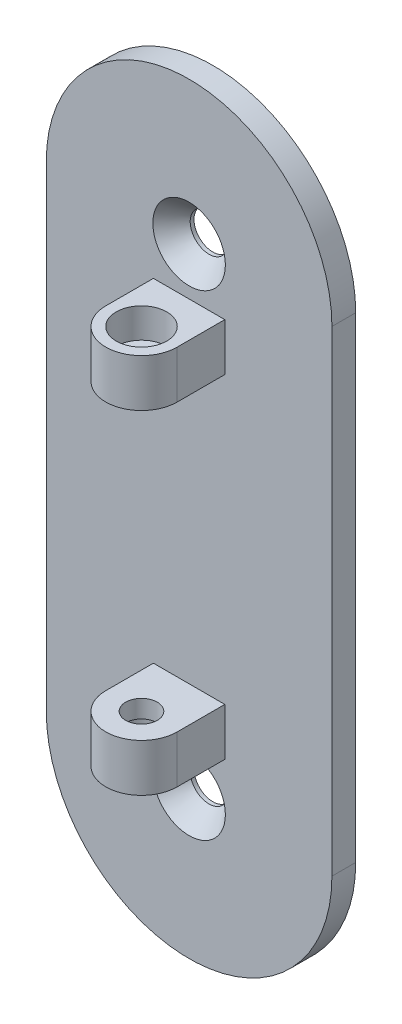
ISO-10303-21;
HEADER;
FILE_DESCRIPTION(('STEP AP214'),'2;1');
FILE_NAME('part.step','',(''),(''),'','','');
FILE_SCHEMA(('AUTOMOTIVE_DESIGN { 1 0 10303 214 1 1 1 1 }'));
ENDSEC;
DATA;
#1=APPLICATION_CONTEXT('core data for automotive mechanical design processes');
#2=APPLICATION_PROTOCOL_DEFINITION('international standard','automotive_design',2000,#1);
#3=PRODUCT_CONTEXT('',#1,'mechanical');
#4=PRODUCT('Part','Part','',(#3));
#5=PRODUCT_RELATED_PRODUCT_CATEGORY('part','',(#4));
#6=PRODUCT_DEFINITION_FORMATION('','',#4);
#7=PRODUCT_DEFINITION_CONTEXT('part definition',#1,'design');
#8=PRODUCT_DEFINITION('design','',#6,#7);
#9=PRODUCT_DEFINITION_SHAPE('','',#8);
#10=(LENGTH_UNIT() NAMED_UNIT(*) SI_UNIT(.MILLI.,.METRE.));
#11=(NAMED_UNIT(*) PLANE_ANGLE_UNIT() SI_UNIT($,.RADIAN.));
#12=(NAMED_UNIT(*) SI_UNIT($,.STERADIAN.) SOLID_ANGLE_UNIT());
#13=UNCERTAINTY_MEASURE_WITH_UNIT(LENGTH_MEASURE(1.E-05),#10,'distance_accuracy_value','');
#14=(GEOMETRIC_REPRESENTATION_CONTEXT(3) GLOBAL_UNCERTAINTY_ASSIGNED_CONTEXT((#13)) GLOBAL_UNIT_ASSIGNED_CONTEXT((#10,
#11,#12)) REPRESENTATION_CONTEXT('',''));
#15=CARTESIAN_POINT('',(0.,0.,0.));
#16=DIRECTION('',(0.,0.,1.));
#17=DIRECTION('',(1.,0.,0.));
#18=AXIS2_PLACEMENT_3D('',#15,#16,#17);
#19=CARTESIAN_POINT('',(38.1,63.5,6.35));
#20=DIRECTION('',(0.,0.,-1.));
#21=DIRECTION('',(-1.,0.,0.));
#22=AXIS2_PLACEMENT_3D('',#19,#20,#21);
#23=PLANE('',#22);
#24=DIRECTION('',(0.,-1.,0.));
#25=VECTOR('',#24,1.);
#26=CARTESIAN_POINT('',(0.,0.,6.35));
#27=LINE('',#26,#25);
#28=CARTESIAN_POINT('',(0.,63.5,6.35));
#29=VERTEX_POINT('',#28);
#30=CARTESIAN_POINT('',(0.,-63.5,6.35));
#31=VERTEX_POINT('',#30);
#32=EDGE_CURVE('E240',#29,#31,#27,.T.);
#33=ORIENTED_EDGE('',*,*,#32,.T.);
#34=CARTESIAN_POINT('',(38.1,-63.5,6.35));
#35=DIRECTION('',(0.,0.,-1.));
#36=DIRECTION('',(-1.,0.,0.));
#37=AXIS2_PLACEMENT_3D('',#34,#35,#36);
#38=CIRCLE('',#37,38.1);
#39=CARTESIAN_POINT('',(76.2,-63.5,6.35));
#40=VERTEX_POINT('',#39);
#41=EDGE_CURVE('E169',#40,#31,#38,.T.);
#42=ORIENTED_EDGE('',*,*,#41,.F.);
#43=DIRECTION('',(0.,1.,0.));
#44=VECTOR('',#43,1.);
#45=CARTESIAN_POINT('',(76.2,63.5,6.35));
#46=LINE('',#45,#44);
#47=CARTESIAN_POINT('',(76.2,63.5,6.35));
#48=VERTEX_POINT('',#47);
#49=EDGE_CURVE('E236',#40,#48,#46,.T.);
#50=ORIENTED_EDGE('',*,*,#49,.T.);
#51=CARTESIAN_POINT('',(38.1,63.5,6.35));
#52=DIRECTION('',(0.,0.,1.));
#53=DIRECTION('',(-1.,0.,0.));
#54=AXIS2_PLACEMENT_3D('',#51,#52,#53);
#55=CIRCLE('',#54,38.1);
#56=EDGE_CURVE('E238',#48,#29,#55,.T.);
#57=ORIENTED_EDGE('',*,*,#56,.T.);
#58=EDGE_LOOP('',(#33,#42,#50,#57));
#59=FACE_BOUND('',#58,.T.);
#60=CARTESIAN_POINT('',(38.1,63.5,6.35));
#61=DIRECTION('',(0.,0.,1.));
#62=DIRECTION('',(1.,0.,0.));
#63=AXIS2_PLACEMENT_3D('',#60,#61,#62);
#64=CIRCLE('',#63,9.6774);
#65=CARTESIAN_POINT('',(47.7774,63.5,6.35));
#66=VERTEX_POINT('',#65);
#67=EDGE_CURVE('E227',#66,#66,#64,.T.);
#68=ORIENTED_EDGE('',*,*,#67,.F.);
#69=EDGE_LOOP('',(#68));
#70=FACE_BOUND('',#69,.T.);
#71=DIRECTION('',(0.,-1.,0.));
#72=VECTOR('',#71,1.);
#73=CARTESIAN_POINT('',(28.575,50.8,6.35));
#74=LINE('',#73,#72);
#75=CARTESIAN_POINT('',(28.575,50.8,6.35));
#76=VERTEX_POINT('',#75);
#77=CARTESIAN_POINT('',(28.575,38.1,6.35));
#78=VERTEX_POINT('',#77);
#79=EDGE_CURVE('E194',#76,#78,#74,.T.);
#80=ORIENTED_EDGE('',*,*,#79,.F.);
#81=DIRECTION('',(-1.,0.,0.));
#82=VECTOR('',#81,1.);
#83=CARTESIAN_POINT('',(28.575,50.8,6.35));
#84=LINE('',#83,#82);
#85=CARTESIAN_POINT('',(47.625,50.8,6.35));
#86=VERTEX_POINT('',#85);
#87=EDGE_CURVE('E201',#86,#76,#84,.T.);
#88=ORIENTED_EDGE('',*,*,#87,.F.);
#89=DIRECTION('',(0.,1.,0.));
#90=VECTOR('',#89,1.);
#91=CARTESIAN_POINT('',(47.625,50.8,6.35));
#92=LINE('',#91,#90);
#93=CARTESIAN_POINT('',(47.625,38.1,6.35));
#94=VERTEX_POINT('',#93);
#95=EDGE_CURVE('E46',#94,#86,#92,.T.);
#96=ORIENTED_EDGE('',*,*,#95,.F.);
#97=DIRECTION('',(1.,0.,0.));
#98=VECTOR('',#97,1.);
#99=CARTESIAN_POINT('',(28.575,38.1,6.35));
#100=LINE('',#99,#98);
#101=EDGE_CURVE('E41',#78,#94,#100,.T.);
#102=ORIENTED_EDGE('',*,*,#101,.F.);
#103=EDGE_LOOP('',(#80,#88,#96,#102));
#104=FACE_BOUND('',#103,.T.);
#105=CARTESIAN_POINT('',(38.1,-63.5,6.35));
#106=DIRECTION('',(0.,0.,-1.));
#107=DIRECTION('',(1.,0.,0.));
#108=AXIS2_PLACEMENT_3D('',#105,#106,#107);
#109=CIRCLE('',#108,9.6774);
#110=CARTESIAN_POINT('',(47.7774,-63.5,6.35));
#111=VERTEX_POINT('',#110);
#112=EDGE_CURVE('E163',#111,#111,#109,.T.);
#113=ORIENTED_EDGE('',*,*,#112,.T.);
#114=EDGE_LOOP('',(#113));
#115=FACE_BOUND('',#114,.T.);
#116=DIRECTION('',(0.,1.,0.));
#117=VECTOR('',#116,1.);
#118=CARTESIAN_POINT('',(28.575,-50.8,6.35));
#119=LINE('',#118,#117);
#120=CARTESIAN_POINT('',(28.575,-50.8,6.35));
#121=VERTEX_POINT('',#120);
#122=CARTESIAN_POINT('',(28.575,-38.1,6.35));
#123=VERTEX_POINT('',#122);
#124=EDGE_CURVE('E138',#121,#123,#119,.T.);
#125=ORIENTED_EDGE('',*,*,#124,.T.);
#126=DIRECTION('',(1.,0.,0.));
#127=VECTOR('',#126,1.);
#128=CARTESIAN_POINT('',(28.575,-38.1,6.35));
#129=LINE('',#128,#127);
#130=CARTESIAN_POINT('',(47.625,-38.1,6.35));
#131=VERTEX_POINT('',#130);
#132=EDGE_CURVE('E141',#123,#131,#129,.T.);
#133=ORIENTED_EDGE('',*,*,#132,.T.);
#134=DIRECTION('',(0.,-1.,0.));
#135=VECTOR('',#134,1.);
#136=CARTESIAN_POINT('',(47.625,-50.8,6.35));
#137=LINE('',#136,#135);
#138=CARTESIAN_POINT('',(47.625,-50.8,6.35));
#139=VERTEX_POINT('',#138);
#140=EDGE_CURVE('E129',#131,#139,#137,.T.);
#141=ORIENTED_EDGE('',*,*,#140,.T.);
#142=DIRECTION('',(-1.,0.,0.));
#143=VECTOR('',#142,1.);
#144=CARTESIAN_POINT('',(28.575,-50.8,6.35));
#145=LINE('',#144,#143);
#146=EDGE_CURVE('E150',#139,#121,#145,.T.);
#147=ORIENTED_EDGE('',*,*,#146,.T.);
#148=EDGE_LOOP('',(#125,#133,#141,#147));
#149=FACE_BOUND('',#148,.T.);
#150=ADVANCED_FACE('F26',(#59,#70,#104,#115,#149),#23,.F.);
#151=CARTESIAN_POINT('',(38.1,63.5,0.));
#152=DIRECTION('',(0.,0.,-1.));
#153=DIRECTION('',(-1.,0.,0.));
#154=AXIS2_PLACEMENT_3D('',#151,#152,#153);
#155=PLANE('',#154);
#156=DIRECTION('',(0.,1.,0.));
#157=VECTOR('',#156,1.);
#158=CARTESIAN_POINT('',(76.2,63.5,0.));
#159=LINE('',#158,#157);
#160=CARTESIAN_POINT('',(76.2,-63.5,0.));
#161=VERTEX_POINT('',#160);
#162=CARTESIAN_POINT('',(76.2,63.5,0.));
#163=VERTEX_POINT('',#162);
#164=EDGE_CURVE('E230',#161,#163,#159,.T.);
#165=ORIENTED_EDGE('',*,*,#164,.F.);
#166=CARTESIAN_POINT('',(38.1,-63.5,0.));
#167=DIRECTION('',(0.,0.,-1.));
#168=DIRECTION('',(-1.,0.,0.));
#169=AXIS2_PLACEMENT_3D('',#166,#167,#168);
#170=CIRCLE('',#169,38.1);
#171=CARTESIAN_POINT('',(0.,-63.5,0.));
#172=VERTEX_POINT('',#171);
#173=EDGE_CURVE('E166',#161,#172,#170,.T.);
#174=ORIENTED_EDGE('',*,*,#173,.T.);
#175=DIRECTION('',(0.,-1.,0.));
#176=VECTOR('',#175,1.);
#177=CARTESIAN_POINT('',(0.,0.,0.));
#178=LINE('',#177,#176);
#179=CARTESIAN_POINT('',(0.,63.5,0.));
#180=VERTEX_POINT('',#179);
#181=EDGE_CURVE('E234',#180,#172,#178,.T.);
#182=ORIENTED_EDGE('',*,*,#181,.F.);
#183=CARTESIAN_POINT('',(38.1,63.5,0.));
#184=DIRECTION('',(0.,0.,1.));
#185=DIRECTION('',(-1.,0.,0.));
#186=AXIS2_PLACEMENT_3D('',#183,#184,#185);
#187=CIRCLE('',#186,38.1);
#188=EDGE_CURVE('E232',#163,#180,#187,.T.);
#189=ORIENTED_EDGE('',*,*,#188,.F.);
#190=EDGE_LOOP('',(#165,#174,#182,#189));
#191=FACE_BOUND('',#190,.T.);
#192=CARTESIAN_POINT('',(38.1,63.5,0.));
#193=DIRECTION('',(0.,0.,1.));
#194=DIRECTION('',(1.,0.,0.));
#195=AXIS2_PLACEMENT_3D('',#192,#193,#194);
#196=CIRCLE('',#195,5.04189999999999);
#197=CARTESIAN_POINT('',(43.1419,63.5,0.));
#198=VERTEX_POINT('',#197);
#199=EDGE_CURVE('E221',#198,#198,#196,.T.);
#200=ORIENTED_EDGE('',*,*,#199,.T.);
#201=EDGE_LOOP('',(#200));
#202=FACE_BOUND('',#201,.T.);
#203=CARTESIAN_POINT('',(38.1,-63.5,0.));
#204=DIRECTION('',(0.,0.,-1.));
#205=DIRECTION('',(1.,0.,0.));
#206=AXIS2_PLACEMENT_3D('',#203,#204,#205);
#207=CIRCLE('',#206,5.04189999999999);
#208=CARTESIAN_POINT('',(43.1419,-63.5,0.));
#209=VERTEX_POINT('',#208);
#210=EDGE_CURVE('E157',#209,#209,#207,.T.);
#211=ORIENTED_EDGE('',*,*,#210,.F.);
#212=EDGE_LOOP('',(#211));
#213=FACE_BOUND('',#212,.T.);
#214=ADVANCED_FACE('F252',(#191,#202,#213),#155,.T.);
#215=CARTESIAN_POINT('',(76.2,63.5,6.35));
#216=DIRECTION('',(-1.,0.,0.));
#217=DIRECTION('',(0.,-1.,0.));
#218=AXIS2_PLACEMENT_3D('',#215,#216,#217);
#219=PLANE('',#218);
#220=ORIENTED_EDGE('',*,*,#164,.T.);
#221=DIRECTION('',(0.,0.,-1.));
#222=VECTOR('',#221,1.);
#223=CARTESIAN_POINT('',(76.2,63.5,6.35));
#224=LINE('',#223,#222);
#225=EDGE_CURVE('E11',#48,#163,#224,.T.);
#226=ORIENTED_EDGE('',*,*,#225,.F.);
#227=ORIENTED_EDGE('',*,*,#49,.F.);
#228=DIRECTION('',(0.,0.,-1.));
#229=VECTOR('',#228,1.);
#230=CARTESIAN_POINT('',(76.2,-63.5,6.35));
#231=LINE('',#230,#229);
#232=EDGE_CURVE('E175',#40,#161,#231,.T.);
#233=ORIENTED_EDGE('',*,*,#232,.T.);
#234=EDGE_LOOP('',(#220,#226,#227,#233));
#235=FACE_BOUND('',#234,.T.);
#236=ADVANCED_FACE('F28',(#235),#219,.F.);
#237=CARTESIAN_POINT('',(38.1,63.5,6.35));
#238=DIRECTION('',(0.,0.,-1.));
#239=DIRECTION('',(-1.,0.,0.));
#240=AXIS2_PLACEMENT_3D('',#237,#238,#239);
#241=CYLINDRICAL_SURFACE('',#240,38.1);
#242=ORIENTED_EDGE('',*,*,#188,.T.);
#243=DIRECTION('',(0.,0.,-1.));
#244=VECTOR('',#243,1.);
#245=CARTESIAN_POINT('',(0.,63.5,6.35));
#246=LINE('',#245,#244);
#247=EDGE_CURVE('E34',#29,#180,#246,.T.);
#248=ORIENTED_EDGE('',*,*,#247,.F.);
#249=ORIENTED_EDGE('',*,*,#56,.F.);
#250=ORIENTED_EDGE('',*,*,#225,.T.);
#251=EDGE_LOOP('',(#242,#248,#249,#250));
#252=FACE_BOUND('',#251,.T.);
#253=ADVANCED_FACE('F262',(#252),#241,.T.);
#254=CARTESIAN_POINT('',(0.,0.,6.35));
#255=DIRECTION('',(1.,0.,0.));
#256=DIRECTION('',(0.,0.,-1.));
#257=AXIS2_PLACEMENT_3D('',#254,#255,#256);
#258=PLANE('',#257);
#259=ORIENTED_EDGE('',*,*,#181,.T.);
#260=DIRECTION('',(0.,0.,-1.));
#261=VECTOR('',#260,1.);
#262=CARTESIAN_POINT('',(0.,-63.5,6.35));
#263=LINE('',#262,#261);
#264=EDGE_CURVE('E172',#31,#172,#263,.T.);
#265=ORIENTED_EDGE('',*,*,#264,.F.);
#266=ORIENTED_EDGE('',*,*,#32,.F.);
#267=ORIENTED_EDGE('',*,*,#247,.T.);
#268=EDGE_LOOP('',(#259,#265,#266,#267));
#269=FACE_BOUND('',#268,.T.);
#270=ADVANCED_FACE('F246',(#269),#258,.F.);
#271=CARTESIAN_POINT('',(38.1,63.5,6.35));
#272=DIRECTION('',(0.,0.,1.));
#273=DIRECTION('',(1.,0.,0.));
#274=AXIS2_PLACEMENT_3D('',#271,#272,#273);
#275=CONICAL_SURFACE('',#274,9.6774,0.715584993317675);
#276=CARTESIAN_POINT('',(38.1,63.5,1.01746724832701));
#277=DIRECTION('',(0.,0.,1.));
#278=DIRECTION('',(1.,0.,0.));
#279=AXIS2_PLACEMENT_3D('',#276,#277,#278);
#280=CIRCLE('',#279,5.04189999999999);
#281=CARTESIAN_POINT('',(43.1419,63.5,1.01746724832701));
#282=VERTEX_POINT('',#281);
#283=EDGE_CURVE('E224',#282,#282,#280,.T.);
#284=ORIENTED_EDGE('',*,*,#283,.F.);
#285=EDGE_LOOP('',(#284));
#286=FACE_BOUND('',#285,.T.);
#287=ORIENTED_EDGE('',*,*,#67,.T.);
#288=EDGE_LOOP('',(#287));
#289=FACE_BOUND('',#288,.T.);
#290=ADVANCED_FACE('F278',(#286,#289),#275,.F.);
#291=CARTESIAN_POINT('',(38.1,63.5,6.35));
#292=DIRECTION('',(0.,0.,1.));
#293=DIRECTION('',(1.,0.,0.));
#294=AXIS2_PLACEMENT_3D('',#291,#292,#293);
#295=CYLINDRICAL_SURFACE('',#294,5.04189999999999);
#296=ORIENTED_EDGE('',*,*,#199,.F.);
#297=EDGE_LOOP('',(#296));
#298=FACE_BOUND('',#297,.T.);
#299=ORIENTED_EDGE('',*,*,#283,.T.);
#300=EDGE_LOOP('',(#299));
#301=FACE_BOUND('',#300,.T.);
#302=ADVANCED_FACE('F283',(#298,#301),#295,.F.);
#303=CARTESIAN_POINT('',(28.575,50.8,19.05));
#304=DIRECTION('',(1.,0.,0.));
#305=DIRECTION('',(0.,0.,-1.));
#306=AXIS2_PLACEMENT_3D('',#303,#304,#305);
#307=PLANE('',#306);
#308=ORIENTED_EDGE('',*,*,#79,.T.);
#309=DIRECTION('',(0.,0.,-1.));
#310=VECTOR('',#309,1.);
#311=CARTESIAN_POINT('',(28.575,38.1,19.05));
#312=LINE('',#311,#310);
#313=CARTESIAN_POINT('',(28.575,38.1,19.05));
#314=VERTEX_POINT('',#313);
#315=EDGE_CURVE('E219',#314,#78,#312,.T.);
#316=ORIENTED_EDGE('',*,*,#315,.F.);
#317=DIRECTION('',(0.,-1.,0.));
#318=VECTOR('',#317,1.);
#319=CARTESIAN_POINT('',(28.575,50.8,19.05));
#320=LINE('',#319,#318);
#321=CARTESIAN_POINT('',(28.575,50.8,19.05));
#322=VERTEX_POINT('',#321);
#323=EDGE_CURVE('E204',#322,#314,#320,.T.);
#324=ORIENTED_EDGE('',*,*,#323,.F.);
#325=DIRECTION('',(0.,0.,-1.));
#326=VECTOR('',#325,1.);
#327=CARTESIAN_POINT('',(28.575,50.8,19.05));
#328=LINE('',#327,#326);
#329=EDGE_CURVE('E210',#322,#76,#328,.T.);
#330=ORIENTED_EDGE('',*,*,#329,.T.);
#331=EDGE_LOOP('',(#308,#316,#324,#330));
#332=FACE_BOUND('',#331,.T.);
#333=ADVANCED_FACE('F290',(#332),#307,.F.);
#334=CARTESIAN_POINT('',(28.575,38.1,19.05));
#335=DIRECTION('',(0.,1.,0.));
#336=DIRECTION('',(0.,0.,1.));
#337=AXIS2_PLACEMENT_3D('',#334,#335,#336);
#338=PLANE('',#337);
#339=CARTESIAN_POINT('',(38.1,38.1,19.05));
#340=DIRECTION('',(0.,1.,0.));
#341=DIRECTION('',(0.,0.,1.));
#342=AXIS2_PLACEMENT_3D('',#339,#340,#341);
#343=CIRCLE('',#342,4.21639999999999);
#344=CARTESIAN_POINT('',(38.1,38.1,23.2664));
#345=VERTEX_POINT('',#344);
#346=EDGE_CURVE('E178',#345,#345,#343,.T.);
#347=ORIENTED_EDGE('',*,*,#346,.T.);
#348=EDGE_LOOP('',(#347));
#349=FACE_BOUND('',#348,.T.);
#350=ORIENTED_EDGE('',*,*,#101,.T.);
#351=DIRECTION('',(0.,0.,-1.));
#352=VECTOR('',#351,1.);
#353=CARTESIAN_POINT('',(47.625,38.1,19.05));
#354=LINE('',#353,#352);
#355=CARTESIAN_POINT('',(47.625,38.1,19.05));
#356=VERTEX_POINT('',#355);
#357=EDGE_CURVE('E216',#356,#94,#354,.T.);
#358=ORIENTED_EDGE('',*,*,#357,.F.);
#359=CARTESIAN_POINT('',(38.1,38.1,19.05));
#360=DIRECTION('',(0.,1.,0.));
#361=DIRECTION('',(0.,0.,1.));
#362=AXIS2_PLACEMENT_3D('',#359,#360,#361);
#363=CIRCLE('',#362,9.525);
#364=EDGE_CURVE('E191',#356,#314,#363,.F.);
#365=ORIENTED_EDGE('',*,*,#364,.T.);
#366=ORIENTED_EDGE('',*,*,#315,.T.);
#367=EDGE_LOOP('',(#350,#358,#365,#366));
#368=FACE_BOUND('',#367,.T.);
#369=ADVANCED_FACE('F298',(#349,#368),#338,.F.);
#370=CARTESIAN_POINT('',(47.625,50.8,19.05));
#371=DIRECTION('',(-1.,0.,0.));
#372=DIRECTION('',(0.,0.,1.));
#373=AXIS2_PLACEMENT_3D('',#370,#371,#372);
#374=PLANE('',#373);
#375=ORIENTED_EDGE('',*,*,#95,.T.);
#376=DIRECTION('',(0.,0.,-1.));
#377=VECTOR('',#376,1.);
#378=CARTESIAN_POINT('',(47.625,50.8,19.05));
#379=LINE('',#378,#377);
#380=CARTESIAN_POINT('',(47.625,50.8,19.05));
#381=VERTEX_POINT('',#380);
#382=EDGE_CURVE('E213',#381,#86,#379,.T.);
#383=ORIENTED_EDGE('',*,*,#382,.F.);
#384=DIRECTION('',(0.,1.,0.));
#385=VECTOR('',#384,1.);
#386=CARTESIAN_POINT('',(47.625,50.8,19.05));
#387=LINE('',#386,#385);
#388=EDGE_CURVE('E207',#356,#381,#387,.T.);
#389=ORIENTED_EDGE('',*,*,#388,.F.);
#390=ORIENTED_EDGE('',*,*,#357,.T.);
#391=EDGE_LOOP('',(#375,#383,#389,#390));
#392=FACE_BOUND('',#391,.T.);
#393=ADVANCED_FACE('F302',(#392),#374,.F.);
#394=CARTESIAN_POINT('',(28.575,50.8,19.05));
#395=DIRECTION('',(0.,-1.,0.));
#396=DIRECTION('',(0.,0.,-1.));
#397=AXIS2_PLACEMENT_3D('',#394,#395,#396);
#398=PLANE('',#397);
#399=CARTESIAN_POINT('',(38.1,50.8,19.05));
#400=DIRECTION('',(0.,1.,0.));
#401=DIRECTION('',(0.,0.,1.));
#402=AXIS2_PLACEMENT_3D('',#399,#400,#401);
#403=CIRCLE('',#402,6.74751);
#404=CARTESIAN_POINT('',(38.1,50.8,25.79751));
#405=VERTEX_POINT('',#404);
#406=EDGE_CURVE('E187',#405,#405,#403,.T.);
#407=ORIENTED_EDGE('',*,*,#406,.F.);
#408=EDGE_LOOP('',(#407));
#409=FACE_BOUND('',#408,.T.);
#410=ORIENTED_EDGE('',*,*,#87,.T.);
#411=ORIENTED_EDGE('',*,*,#329,.F.);
#412=CARTESIAN_POINT('',(38.1,50.8,19.05));
#413=DIRECTION('',(0.,1.,0.));
#414=DIRECTION('',(0.,0.,1.));
#415=AXIS2_PLACEMENT_3D('',#412,#413,#414);
#416=CIRCLE('',#415,9.525);
#417=EDGE_CURVE('E190',#322,#381,#416,.T.);
#418=ORIENTED_EDGE('',*,*,#417,.T.);
#419=ORIENTED_EDGE('',*,*,#382,.T.);
#420=EDGE_LOOP('',(#410,#411,#418,#419));
#421=FACE_BOUND('',#420,.T.);
#422=ADVANCED_FACE('F306',(#409,#421),#398,.F.);
#423=CARTESIAN_POINT('',(38.1,16.8014525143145,19.05));
#424=DIRECTION('',(0.,1.,0.));
#425=DIRECTION('',(0.,0.,1.));
#426=AXIS2_PLACEMENT_3D('',#423,#424,#425);
#427=CYLINDRICAL_SURFACE('',#426,9.525);
#428=ORIENTED_EDGE('',*,*,#364,.F.);
#429=ORIENTED_EDGE('',*,*,#388,.T.);
#430=ORIENTED_EDGE('',*,*,#417,.F.);
#431=ORIENTED_EDGE('',*,*,#323,.T.);
#432=EDGE_LOOP('',(#428,#429,#430,#431));
#433=FACE_BOUND('',#432,.T.);
#434=ADVANCED_FACE('F310',(#433),#427,.T.);
#435=CARTESIAN_POINT('',(38.1,50.8,19.05));
#436=DIRECTION('',(0.,1.,0.));
#437=DIRECTION('',(0.,0.,1.));
#438=AXIS2_PLACEMENT_3D('',#435,#436,#437);
#439=CYLINDRICAL_SURFACE('',#438,6.74751);
#440=CARTESIAN_POINT('',(38.1,42.8625,19.05));
#441=DIRECTION('',(0.,1.,0.));
#442=DIRECTION('',(0.,0.,1.));
#443=AXIS2_PLACEMENT_3D('',#440,#441,#442);
#444=CIRCLE('',#443,6.74751);
#445=CARTESIAN_POINT('',(38.1,42.8625,25.79751));
#446=VERTEX_POINT('',#445);
#447=EDGE_CURVE('E184',#446,#446,#444,.T.);
#448=ORIENTED_EDGE('',*,*,#447,.F.);
#449=EDGE_LOOP('',(#448));
#450=FACE_BOUND('',#449,.T.);
#451=ORIENTED_EDGE('',*,*,#406,.T.);
#452=EDGE_LOOP('',(#451));
#453=FACE_BOUND('',#452,.T.);
#454=ADVANCED_FACE('F314',(#450,#453),#439,.F.);
#455=CARTESIAN_POINT('',(42.3164,42.8625,19.05));
#456=DIRECTION('',(0.,-1.,0.));
#457=DIRECTION('',(0.,0.,-1.));
#458=AXIS2_PLACEMENT_3D('',#455,#456,#457);
#459=PLANE('',#458);
#460=CARTESIAN_POINT('',(38.1,42.8625,19.05));
#461=DIRECTION('',(0.,1.,0.));
#462=DIRECTION('',(0.,0.,1.));
#463=AXIS2_PLACEMENT_3D('',#460,#461,#462);
#464=CIRCLE('',#463,4.21639999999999);
#465=CARTESIAN_POINT('',(38.1,42.8625,23.2664));
#466=VERTEX_POINT('',#465);
#467=EDGE_CURVE('E181',#466,#466,#464,.T.);
#468=ORIENTED_EDGE('',*,*,#467,.F.);
#469=EDGE_LOOP('',(#468));
#470=FACE_BOUND('',#469,.T.);
#471=ORIENTED_EDGE('',*,*,#447,.T.);
#472=EDGE_LOOP('',(#471));
#473=FACE_BOUND('',#472,.T.);
#474=ADVANCED_FACE('F318',(#470,#473),#459,.F.);
#475=CARTESIAN_POINT('',(38.1,50.8,19.05));
#476=DIRECTION('',(0.,1.,0.));
#477=DIRECTION('',(0.,0.,1.));
#478=AXIS2_PLACEMENT_3D('',#475,#476,#477);
#479=CYLINDRICAL_SURFACE('',#478,4.21639999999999);
#480=ORIENTED_EDGE('',*,*,#346,.F.);
#481=EDGE_LOOP('',(#480));
#482=FACE_BOUND('',#481,.T.);
#483=ORIENTED_EDGE('',*,*,#467,.T.);
#484=EDGE_LOOP('',(#483));
#485=FACE_BOUND('',#484,.T.);
#486=ADVANCED_FACE('F322',(#482,#485),#479,.F.);
#487=CARTESIAN_POINT('',(38.1,-63.5,6.35));
#488=DIRECTION('',(0.,0.,-1.));
#489=DIRECTION('',(-1.,0.,0.));
#490=AXIS2_PLACEMENT_3D('',#487,#488,#489);
#491=CYLINDRICAL_SURFACE('',#490,38.1);
#492=ORIENTED_EDGE('',*,*,#173,.F.);
#493=ORIENTED_EDGE('',*,*,#232,.F.);
#494=ORIENTED_EDGE('',*,*,#41,.T.);
#495=ORIENTED_EDGE('',*,*,#264,.T.);
#496=EDGE_LOOP('',(#492,#493,#494,#495));
#497=FACE_BOUND('',#496,.T.);
#498=ADVANCED_FACE('F257',(#497),#491,.T.);
#499=CARTESIAN_POINT('',(38.1,-63.5,6.35));
#500=DIRECTION('',(0.,0.,1.));
#501=DIRECTION('',(1.,0.,0.));
#502=AXIS2_PLACEMENT_3D('',#499,#500,#501);
#503=CONICAL_SURFACE('',#502,9.6774,0.715584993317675);
#504=CARTESIAN_POINT('',(38.1,-63.5,1.01746724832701));
#505=DIRECTION('',(0.,0.,-1.));
#506=DIRECTION('',(1.,0.,0.));
#507=AXIS2_PLACEMENT_3D('',#504,#505,#506);
#508=CIRCLE('',#507,5.04189999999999);
#509=CARTESIAN_POINT('',(43.1419,-63.5,1.01746724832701));
#510=VERTEX_POINT('',#509);
#511=EDGE_CURVE('E160',#510,#510,#508,.T.);
#512=ORIENTED_EDGE('',*,*,#511,.T.);
#513=EDGE_LOOP('',(#512));
#514=FACE_BOUND('',#513,.T.);
#515=ORIENTED_EDGE('',*,*,#112,.F.);
#516=EDGE_LOOP('',(#515));
#517=FACE_BOUND('',#516,.T.);
#518=ADVANCED_FACE('F328',(#514,#517),#503,.F.);
#519=CARTESIAN_POINT('',(38.1,-63.5,6.35));
#520=DIRECTION('',(0.,0.,1.));
#521=DIRECTION('',(1.,0.,0.));
#522=AXIS2_PLACEMENT_3D('',#519,#520,#521);
#523=CYLINDRICAL_SURFACE('',#522,5.04189999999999);
#524=ORIENTED_EDGE('',*,*,#210,.T.);
#525=EDGE_LOOP('',(#524));
#526=FACE_BOUND('',#525,.T.);
#527=ORIENTED_EDGE('',*,*,#511,.F.);
#528=EDGE_LOOP('',(#527));
#529=FACE_BOUND('',#528,.T.);
#530=ADVANCED_FACE('F331',(#526,#529),#523,.F.);
#531=CARTESIAN_POINT('',(28.575,-50.8,19.05));
#532=DIRECTION('',(1.,0.,0.));
#533=DIRECTION('',(0.,0.,-1.));
#534=AXIS2_PLACEMENT_3D('',#531,#532,#533);
#535=PLANE('',#534);
#536=ORIENTED_EDGE('',*,*,#124,.F.);
#537=DIRECTION('',(0.,0.,-1.));
#538=VECTOR('',#537,1.);
#539=CARTESIAN_POINT('',(28.575,-50.8,19.05));
#540=LINE('',#539,#538);
#541=CARTESIAN_POINT('',(28.575,-50.8,19.05));
#542=VERTEX_POINT('',#541);
#543=EDGE_CURVE('E122',#542,#121,#540,.T.);
#544=ORIENTED_EDGE('',*,*,#543,.F.);
#545=DIRECTION('',(0.,1.,0.));
#546=VECTOR('',#545,1.);
#547=CARTESIAN_POINT('',(28.575,-50.8,19.05));
#548=LINE('',#547,#546);
#549=CARTESIAN_POINT('',(28.575,-38.1,19.05));
#550=VERTEX_POINT('',#549);
#551=EDGE_CURVE('E123',#542,#550,#548,.T.);
#552=ORIENTED_EDGE('',*,*,#551,.T.);
#553=DIRECTION('',(0.,0.,-1.));
#554=VECTOR('',#553,1.);
#555=CARTESIAN_POINT('',(28.575,-38.1,19.05));
#556=LINE('',#555,#554);
#557=EDGE_CURVE('E133',#550,#123,#556,.T.);
#558=ORIENTED_EDGE('',*,*,#557,.T.);
#559=EDGE_LOOP('',(#536,#544,#552,#558));
#560=FACE_BOUND('',#559,.T.);
#561=ADVANCED_FACE('F335',(#560),#535,.F.);
#562=CARTESIAN_POINT('',(28.575,-38.1,19.05));
#563=DIRECTION('',(0.,-1.,0.));
#564=DIRECTION('',(0.,0.,1.));
#565=AXIS2_PLACEMENT_3D('',#562,#563,#564);
#566=PLANE('',#565);
#567=CARTESIAN_POINT('',(38.1,-38.1,19.05));
#568=DIRECTION('',(0.,1.,0.));
#569=DIRECTION('',(0.,0.,1.));
#570=AXIS2_PLACEMENT_3D('',#567,#568,#569);
#571=CIRCLE('',#570,4.21639999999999);
#572=CARTESIAN_POINT('',(38.1,-38.1,23.2664));
#573=VERTEX_POINT('',#572);
#574=EDGE_CURVE('E367',#573,#573,#571,.T.);
#575=ORIENTED_EDGE('',*,*,#574,.F.);
#576=EDGE_LOOP('',(#575));
#577=FACE_BOUND('',#576,.T.);
#578=ORIENTED_EDGE('',*,*,#132,.F.);
#579=ORIENTED_EDGE('',*,*,#557,.F.);
#580=CARTESIAN_POINT('',(38.1,-38.1,19.05));
#581=DIRECTION('',(0.,1.,0.));
#582=DIRECTION('',(0.,0.,1.));
#583=AXIS2_PLACEMENT_3D('',#580,#581,#582);
#584=CIRCLE('',#583,9.525);
#585=CARTESIAN_POINT('',(47.625,-38.1,19.05));
#586=VERTEX_POINT('',#585);
#587=EDGE_CURVE('E117',#586,#550,#584,.F.);
#588=ORIENTED_EDGE('',*,*,#587,.F.);
#589=DIRECTION('',(0.,0.,-1.));
#590=VECTOR('',#589,1.);
#591=CARTESIAN_POINT('',(47.625,-38.1,19.05));
#592=LINE('',#591,#590);
#593=EDGE_CURVE('E126',#586,#131,#592,.T.);
#594=ORIENTED_EDGE('',*,*,#593,.T.);
#595=EDGE_LOOP('',(#578,#579,#588,#594));
#596=FACE_BOUND('',#595,.T.);
#597=ADVANCED_FACE('F136',(#577,#596),#566,.F.);
#598=CARTESIAN_POINT('',(47.625,-50.8,19.05));
#599=DIRECTION('',(-1.,0.,0.));
#600=DIRECTION('',(0.,0.,1.));
#601=AXIS2_PLACEMENT_3D('',#598,#599,#600);
#602=PLANE('',#601);
#603=ORIENTED_EDGE('',*,*,#140,.F.);
#604=ORIENTED_EDGE('',*,*,#593,.F.);
#605=DIRECTION('',(0.,-1.,0.));
#606=VECTOR('',#605,1.);
#607=CARTESIAN_POINT('',(47.625,-50.8,19.05));
#608=LINE('',#607,#606);
#609=CARTESIAN_POINT('',(47.625,-50.8,19.05));
#610=VERTEX_POINT('',#609);
#611=EDGE_CURVE('E112',#586,#610,#608,.T.);
#612=ORIENTED_EDGE('',*,*,#611,.T.);
#613=DIRECTION('',(0.,0.,-1.));
#614=VECTOR('',#613,1.);
#615=CARTESIAN_POINT('',(47.625,-50.8,19.05));
#616=LINE('',#615,#614);
#617=EDGE_CURVE('E134',#610,#139,#616,.T.);
#618=ORIENTED_EDGE('',*,*,#617,.T.);
#619=EDGE_LOOP('',(#603,#604,#612,#618));
#620=FACE_BOUND('',#619,.T.);
#621=ADVANCED_FACE('F127',(#620),#602,.F.);
#622=CARTESIAN_POINT('',(28.575,-50.8,19.05));
#623=DIRECTION('',(0.,1.,0.));
#624=DIRECTION('',(0.,0.,-1.));
#625=AXIS2_PLACEMENT_3D('',#622,#623,#624);
#626=PLANE('',#625);
#627=CARTESIAN_POINT('',(38.1,-50.8,19.05));
#628=DIRECTION('',(0.,1.,0.));
#629=DIRECTION('',(0.,0.,1.));
#630=AXIS2_PLACEMENT_3D('',#627,#628,#629);
#631=CIRCLE('',#630,6.74751);
#632=CARTESIAN_POINT('',(38.1,-50.8,25.79751));
#633=VERTEX_POINT('',#632);
#634=EDGE_CURVE('E143',#633,#633,#631,.T.);
#635=ORIENTED_EDGE('',*,*,#634,.T.);
#636=EDGE_LOOP('',(#635));
#637=FACE_BOUND('',#636,.T.);
#638=ORIENTED_EDGE('',*,*,#146,.F.);
#639=ORIENTED_EDGE('',*,*,#617,.F.);
#640=CARTESIAN_POINT('',(38.1,-50.8,19.05));
#641=DIRECTION('',(0.,1.,0.));
#642=DIRECTION('',(0.,0.,1.));
#643=AXIS2_PLACEMENT_3D('',#640,#641,#642);
#644=CIRCLE('',#643,9.525);
#645=EDGE_CURVE('E119',#542,#610,#644,.T.);
#646=ORIENTED_EDGE('',*,*,#645,.F.);
#647=ORIENTED_EDGE('',*,*,#543,.T.);
#648=EDGE_LOOP('',(#638,#639,#646,#647));
#649=FACE_BOUND('',#648,.T.);
#650=ADVANCED_FACE('F345',(#637,#649),#626,.F.);
#651=CARTESIAN_POINT('',(38.1,-16.8014525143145,19.05));
#652=DIRECTION('',(0.,-1.,0.));
#653=DIRECTION('',(0.,0.,1.));
#654=AXIS2_PLACEMENT_3D('',#651,#652,#653);
#655=CYLINDRICAL_SURFACE('',#654,9.525);
#656=ORIENTED_EDGE('',*,*,#587,.T.);
#657=ORIENTED_EDGE('',*,*,#551,.F.);
#658=ORIENTED_EDGE('',*,*,#645,.T.);
#659=ORIENTED_EDGE('',*,*,#611,.F.);
#660=EDGE_LOOP('',(#656,#657,#658,#659));
#661=FACE_BOUND('',#660,.T.);
#662=ADVANCED_FACE('F114',(#661),#655,.T.);
#663=CARTESIAN_POINT('',(38.1,-50.8,19.05));
#664=DIRECTION('',(0.,-1.,0.));
#665=DIRECTION('',(0.,0.,1.));
#666=AXIS2_PLACEMENT_3D('',#663,#664,#665);
#667=CYLINDRICAL_SURFACE('',#666,6.74751);
#668=CARTESIAN_POINT('',(38.1,-42.8625,19.05));
#669=DIRECTION('',(0.,1.,0.));
#670=DIRECTION('',(0.,0.,1.));
#671=AXIS2_PLACEMENT_3D('',#668,#669,#670);
#672=CIRCLE('',#671,6.74751);
#673=CARTESIAN_POINT('',(38.1,-42.8625,25.79751));
#674=VERTEX_POINT('',#673);
#675=EDGE_CURVE('E371',#674,#674,#672,.T.);
#676=ORIENTED_EDGE('',*,*,#675,.T.);
#677=EDGE_LOOP('',(#676));
#678=FACE_BOUND('',#677,.T.);
#679=ORIENTED_EDGE('',*,*,#634,.F.);
#680=EDGE_LOOP('',(#679));
#681=FACE_BOUND('',#680,.T.);
#682=ADVANCED_FACE('F351',(#678,#681),#667,.F.);
#683=CARTESIAN_POINT('',(42.3164,-42.8625,19.05));
#684=DIRECTION('',(0.,1.,0.));
#685=DIRECTION('',(0.,0.,-1.));
#686=AXIS2_PLACEMENT_3D('',#683,#684,#685);
#687=PLANE('',#686);
#688=CARTESIAN_POINT('',(38.1,-42.8625,19.05));
#689=DIRECTION('',(0.,1.,0.));
#690=DIRECTION('',(0.,0.,1.));
#691=AXIS2_PLACEMENT_3D('',#688,#689,#690);
#692=CIRCLE('',#691,4.21639999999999);
#693=CARTESIAN_POINT('',(38.1,-42.8625,23.2664));
#694=VERTEX_POINT('',#693);
#695=EDGE_CURVE('E370',#694,#694,#692,.T.);
#696=ORIENTED_EDGE('',*,*,#695,.T.);
#697=EDGE_LOOP('',(#696));
#698=FACE_BOUND('',#697,.T.);
#699=ORIENTED_EDGE('',*,*,#675,.F.);
#700=EDGE_LOOP('',(#699));
#701=FACE_BOUND('',#700,.T.);
#702=ADVANCED_FACE('F354',(#698,#701),#687,.F.);
#703=CARTESIAN_POINT('',(38.1,-50.8,19.05));
#704=DIRECTION('',(0.,-1.,0.));
#705=DIRECTION('',(0.,0.,1.));
#706=AXIS2_PLACEMENT_3D('',#703,#704,#705);
#707=CYLINDRICAL_SURFACE('',#706,4.21639999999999);
#708=ORIENTED_EDGE('',*,*,#574,.T.);
#709=EDGE_LOOP('',(#708));
#710=FACE_BOUND('',#709,.T.);
#711=ORIENTED_EDGE('',*,*,#695,.F.);
#712=EDGE_LOOP('',(#711));
#713=FACE_BOUND('',#712,.T.);
#714=ADVANCED_FACE('F358',(#710,#713),#707,.F.);
#715=CLOSED_SHELL('',(#150,#214,#236,#253,#270,#290,#302,#333,#369,#393,#422,#434,#454,#474,
#486,#498,#518,#530,#561,#597,#621,#650,#662,#682,#702,#714));
#716=MANIFOLD_SOLID_BREP('B2',#715);
#717=ADVANCED_BREP_SHAPE_REPRESENTATION('',(#18,#716),#14);
#718=SHAPE_DEFINITION_REPRESENTATION(#9,#717);
ENDSEC;
END-ISO-10303-21;
